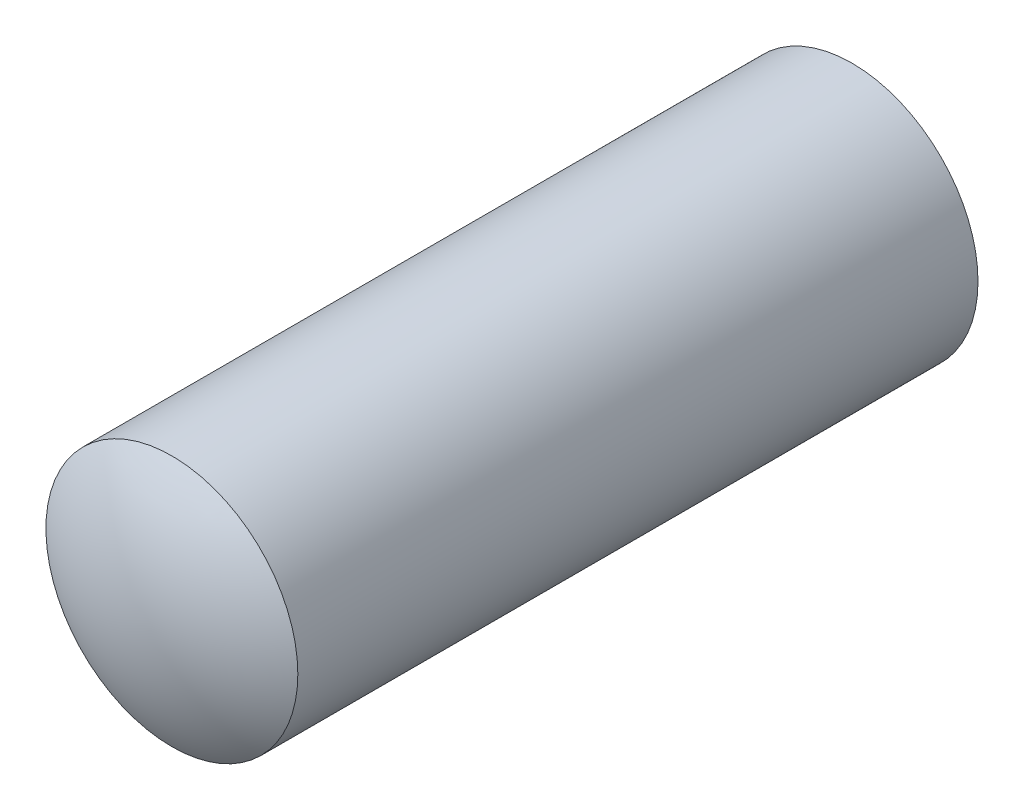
ISO-10303-21;
HEADER;
FILE_DESCRIPTION(('STEP AP214'),'2;1');
FILE_NAME('part.step','',(''),(''),'','','');
FILE_SCHEMA(('AUTOMOTIVE_DESIGN { 1 0 10303 214 1 1 1 1 }'));
ENDSEC;
DATA;
#1=APPLICATION_CONTEXT('core data for automotive mechanical design processes');
#2=APPLICATION_PROTOCOL_DEFINITION('international standard','automotive_design',2000,#1);
#3=PRODUCT_CONTEXT('',#1,'mechanical');
#4=PRODUCT('Part','Part','',(#3));
#5=PRODUCT_RELATED_PRODUCT_CATEGORY('part','',(#4));
#6=PRODUCT_DEFINITION_FORMATION('','',#4);
#7=PRODUCT_DEFINITION_CONTEXT('part definition',#1,'design');
#8=PRODUCT_DEFINITION('design','',#6,#7);
#9=PRODUCT_DEFINITION_SHAPE('','',#8);
#10=(LENGTH_UNIT() NAMED_UNIT(*) SI_UNIT(.MILLI.,.METRE.));
#11=(NAMED_UNIT(*) PLANE_ANGLE_UNIT() SI_UNIT($,.RADIAN.));
#12=(NAMED_UNIT(*) SI_UNIT($,.STERADIAN.) SOLID_ANGLE_UNIT());
#13=UNCERTAINTY_MEASURE_WITH_UNIT(LENGTH_MEASURE(1.E-05),#10,'distance_accuracy_value','');
#14=(GEOMETRIC_REPRESENTATION_CONTEXT(3) GLOBAL_UNCERTAINTY_ASSIGNED_CONTEXT((#13)) GLOBAL_UNIT_ASSIGNED_CONTEXT((#10,
#11,#12)) REPRESENTATION_CONTEXT('',''));
#15=CARTESIAN_POINT('',(0.,0.,0.));
#16=DIRECTION('',(0.,0.,1.));
#17=DIRECTION('',(1.,0.,0.));
#18=AXIS2_PLACEMENT_3D('',#15,#16,#17);
#19=CARTESIAN_POINT('',(0.,0.,-7.26666666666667));
#20=DIRECTION('',(0.,0.,1.));
#21=DIRECTION('',(0.,-1.,0.));
#22=AXIS2_PLACEMENT_3D('',#19,#20,#21);
#23=SPHERICAL_SURFACE('',#22,7.26666666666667);
#24=CARTESIAN_POINT('',(0.,0.,-1.2));
#25=DIRECTION('',(0.,0.,1.));
#26=DIRECTION('',(1.,0.,0.));
#27=AXIS2_PLACEMENT_3D('',#24,#25,#26);
#28=CIRCLE('',#27,4.);
#29=CARTESIAN_POINT('',(4.,0.,-1.2));
#30=VERTEX_POINT('',#29);
#31=EDGE_CURVE('E10',#30,#30,#28,.T.);
#32=ORIENTED_EDGE('',*,*,#31,.T.);
#33=EDGE_LOOP('',(#32));
#34=FACE_BOUND('',#33,.T.);
#35=ADVANCED_FACE('F430',(#34),#23,.T.);
#36=CARTESIAN_POINT('',(0.,0.,10.7228972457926));
#37=DIRECTION('',(0.,0.,1.));
#38=DIRECTION('',(1.,0.,0.));
#39=AXIS2_PLACEMENT_3D('',#36,#37,#38);
#40=CYLINDRICAL_SURFACE('',#39,4.);
#41=ORIENTED_EDGE('',*,*,#31,.F.);
#42=EDGE_LOOP('',(#41));
#43=FACE_BOUND('',#42,.T.);
#44=CARTESIAN_POINT('',(0.,0.,-22.8));
#45=DIRECTION('',(0.,0.,1.));
#46=DIRECTION('',(1.,0.,0.));
#47=AXIS2_PLACEMENT_3D('',#44,#45,#46);
#48=CIRCLE('',#47,4.);
#49=CARTESIAN_POINT('',(4.,0.,-22.8));
#50=VERTEX_POINT('',#49);
#51=EDGE_CURVE('E436',#50,#50,#48,.T.);
#52=ORIENTED_EDGE('',*,*,#51,.T.);
#53=EDGE_LOOP('',(#52));
#54=FACE_BOUND('',#53,.T.);
#55=ADVANCED_FACE('F442',(#43,#54),#40,.T.);
#56=CARTESIAN_POINT('',(0.,0.,-16.7333333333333));
#57=DIRECTION('',(0.,0.,1.));
#58=DIRECTION('',(0.,1.,0.));
#59=AXIS2_PLACEMENT_3D('',#56,#57,#58);
#60=SPHERICAL_SURFACE('',#59,7.26666666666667);
#61=ORIENTED_EDGE('',*,*,#51,.F.);
#62=EDGE_LOOP('',(#61));
#63=FACE_BOUND('',#62,.T.);
#64=ADVANCED_FACE('F444',(#63),#60,.T.);
#65=CLOSED_SHELL('',(#35,#55,#64));
#66=MANIFOLD_SOLID_BREP('B2',#65);
#67=ADVANCED_BREP_SHAPE_REPRESENTATION('',(#18,#66),#14);
#68=SHAPE_DEFINITION_REPRESENTATION(#9,#67);
ENDSEC;
END-ISO-10303-21;
